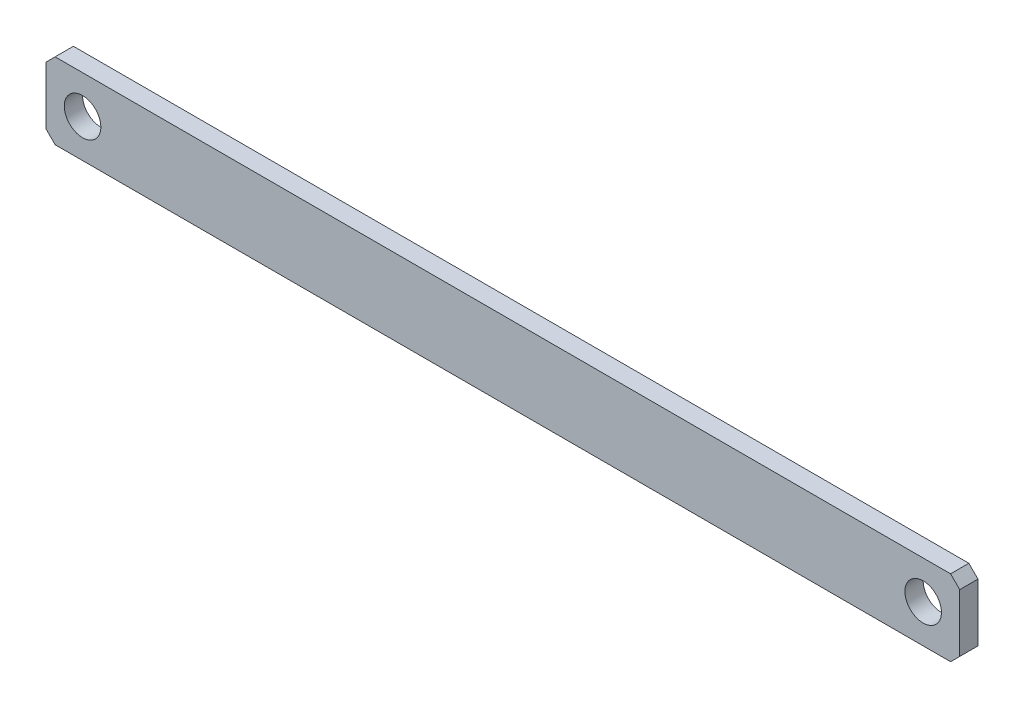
ISO-10303-21;
HEADER;
FILE_DESCRIPTION(('STEP AP214'),'2;1');
FILE_NAME('part.step','',(''),(''),'','','');
FILE_SCHEMA(('AUTOMOTIVE_DESIGN { 1 0 10303 214 1 1 1 1 }'));
ENDSEC;
DATA;
#1=APPLICATION_CONTEXT('core data for automotive mechanical design processes');
#2=APPLICATION_PROTOCOL_DEFINITION('international standard','automotive_design',2000,#1);
#3=PRODUCT_CONTEXT('',#1,'mechanical');
#4=PRODUCT('Part','Part','',(#3));
#5=PRODUCT_RELATED_PRODUCT_CATEGORY('part','',(#4));
#6=PRODUCT_DEFINITION_FORMATION('','',#4);
#7=PRODUCT_DEFINITION_CONTEXT('part definition',#1,'design');
#8=PRODUCT_DEFINITION('design','',#6,#7);
#9=PRODUCT_DEFINITION_SHAPE('','',#8);
#10=(LENGTH_UNIT() NAMED_UNIT(*) SI_UNIT(.MILLI.,.METRE.));
#11=(NAMED_UNIT(*) PLANE_ANGLE_UNIT() SI_UNIT($,.RADIAN.));
#12=(NAMED_UNIT(*) SI_UNIT($,.STERADIAN.) SOLID_ANGLE_UNIT());
#13=UNCERTAINTY_MEASURE_WITH_UNIT(LENGTH_MEASURE(1.E-05),#10,'distance_accuracy_value','');
#14=(GEOMETRIC_REPRESENTATION_CONTEXT(3) GLOBAL_UNCERTAINTY_ASSIGNED_CONTEXT((#13)) GLOBAL_UNIT_ASSIGNED_CONTEXT((#10,
#11,#12)) REPRESENTATION_CONTEXT('',''));
#15=CARTESIAN_POINT('',(0.,0.,0.));
#16=DIRECTION('',(0.,0.,1.));
#17=DIRECTION('',(1.,0.,0.));
#18=AXIS2_PLACEMENT_3D('',#15,#16,#17);
#19=CARTESIAN_POINT('',(0.,7.97330827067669,1.524));
#20=DIRECTION('',(0.,0.,-1.));
#21=DIRECTION('',(-1.,0.,0.));
#22=AXIS2_PLACEMENT_3D('',#19,#20,#21);
#23=PLANE('',#22);
#24=CARTESIAN_POINT('',(3.048,4.79830827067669,1.524));
#25=DIRECTION('',(0.,0.,1.));
#26=DIRECTION('',(1.,0.,0.));
#27=AXIS2_PLACEMENT_3D('',#24,#25,#26);
#28=CIRCLE('',#27,1.524);
#29=CARTESIAN_POINT('',(1.524,4.79830827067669,1.524));
#30=VERTEX_POINT('',#29);
#31=EDGE_CURVE('E167',#30,#30,#28,.T.);
#32=ORIENTED_EDGE('',*,*,#31,.F.);
#33=EDGE_LOOP('',(#32));
#34=FACE_BOUND('',#33,.T.);
#35=DIRECTION('',(1.,0.,0.));
#36=VECTOR('',#35,1.);
#37=CARTESIAN_POINT('',(0.,1.62330827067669,1.524));
#38=LINE('',#37,#36);
#39=CARTESIAN_POINT('',(0.761999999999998,1.62330827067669,1.524));
#40=VERTEX_POINT('',#39);
#41=CARTESIAN_POINT('',(75.438,1.62330827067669,1.524));
#42=VERTEX_POINT('',#41);
#43=EDGE_CURVE('E134',#40,#42,#38,.T.);
#44=ORIENTED_EDGE('',*,*,#43,.T.);
#45=DIRECTION('',(-0.707106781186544,-0.707106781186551,0.));
#46=VECTOR('',#45,1.);
#47=CARTESIAN_POINT('',(76.2,2.3853082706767,1.524));
#48=LINE('',#47,#46);
#49=CARTESIAN_POINT('',(76.2,2.3853082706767,1.524));
#50=VERTEX_POINT('',#49);
#51=EDGE_CURVE('E153',#42,#50,#48,.F.);
#52=ORIENTED_EDGE('',*,*,#51,.T.);
#53=DIRECTION('',(0.,1.,0.));
#54=VECTOR('',#53,1.);
#55=CARTESIAN_POINT('',(76.2,1.6233082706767,1.524));
#56=LINE('',#55,#54);
#57=CARTESIAN_POINT('',(76.2,7.21130827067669,1.524));
#58=VERTEX_POINT('',#57);
#59=EDGE_CURVE('E116',#50,#58,#56,.T.);
#60=ORIENTED_EDGE('',*,*,#59,.T.);
#61=DIRECTION('',(0.707106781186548,-0.707106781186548,0.));
#62=VECTOR('',#61,1.);
#63=CARTESIAN_POINT('',(75.438,7.97330827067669,1.524));
#64=LINE('',#63,#62);
#65=CARTESIAN_POINT('',(75.438,7.9733082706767,1.524));
#66=VERTEX_POINT('',#65);
#67=EDGE_CURVE('E53',#58,#66,#64,.F.);
#68=ORIENTED_EDGE('',*,*,#67,.T.);
#69=DIRECTION('',(-1.,0.,0.));
#70=VECTOR('',#69,1.);
#71=CARTESIAN_POINT('',(0.,7.97330827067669,1.524));
#72=LINE('',#71,#70);
#73=CARTESIAN_POINT('',(0.761999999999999,7.97330827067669,1.524));
#74=VERTEX_POINT('',#73);
#75=EDGE_CURVE('E138',#66,#74,#72,.T.);
#76=ORIENTED_EDGE('',*,*,#75,.T.);
#77=DIRECTION('',(0.707106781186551,0.707106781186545,0.));
#78=VECTOR('',#77,1.);
#79=CARTESIAN_POINT('',(0.,7.2113082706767,1.524));
#80=LINE('',#79,#78);
#81=CARTESIAN_POINT('',(0.,7.2113082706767,1.524));
#82=VERTEX_POINT('',#81);
#83=EDGE_CURVE('E148',#74,#82,#80,.F.);
#84=ORIENTED_EDGE('',*,*,#83,.T.);
#85=DIRECTION('',(0.,-1.,0.));
#86=VECTOR('',#85,1.);
#87=CARTESIAN_POINT('',(0.,1.62330827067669,1.524));
#88=LINE('',#87,#86);
#89=CARTESIAN_POINT('',(0.,2.38530827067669,1.524));
#90=VERTEX_POINT('',#89);
#91=EDGE_CURVE('E126',#82,#90,#88,.T.);
#92=ORIENTED_EDGE('',*,*,#91,.T.);
#93=DIRECTION('',(-0.707106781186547,0.707106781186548,0.));
#94=VECTOR('',#93,1.);
#95=CARTESIAN_POINT('',(0.761999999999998,1.62330827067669,1.524));
#96=LINE('',#95,#94);
#97=EDGE_CURVE('E150',#90,#40,#96,.F.);
#98=ORIENTED_EDGE('',*,*,#97,.T.);
#99=EDGE_LOOP('',(#44,#52,#60,#68,#76,#84,#92,#98));
#100=FACE_BOUND('',#99,.T.);
#101=CARTESIAN_POINT('',(73.152,4.79830827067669,1.524));
#102=DIRECTION('',(0.,0.,1.));
#103=DIRECTION('',(1.,0.,0.));
#104=AXIS2_PLACEMENT_3D('',#101,#102,#103);
#105=CIRCLE('',#104,1.52399999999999);
#106=CARTESIAN_POINT('',(71.628,4.79830827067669,1.524));
#107=VERTEX_POINT('',#106);
#108=EDGE_CURVE('E174',#107,#107,#105,.T.);
#109=ORIENTED_EDGE('',*,*,#108,.F.);
#110=EDGE_LOOP('',(#109));
#111=FACE_BOUND('',#110,.T.);
#112=ADVANCED_FACE('F31',(#34,#100,#111),#23,.F.);
#113=CARTESIAN_POINT('',(0.,7.97330827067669,0.));
#114=DIRECTION('',(0.,0.,-1.));
#115=DIRECTION('',(-1.,0.,0.));
#116=AXIS2_PLACEMENT_3D('',#113,#114,#115);
#117=PLANE('',#116);
#118=CARTESIAN_POINT('',(3.048,4.79830827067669,0.));
#119=DIRECTION('',(0.,0.,1.));
#120=DIRECTION('',(1.,0.,0.));
#121=AXIS2_PLACEMENT_3D('',#118,#119,#120);
#122=CIRCLE('',#121,1.524);
#123=CARTESIAN_POINT('',(1.524,4.79830827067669,0.));
#124=VERTEX_POINT('',#123);
#125=EDGE_CURVE('E169',#124,#124,#122,.T.);
#126=ORIENTED_EDGE('',*,*,#125,.T.);
#127=EDGE_LOOP('',(#126));
#128=FACE_BOUND('',#127,.T.);
#129=DIRECTION('',(0.,1.,0.));
#130=VECTOR('',#129,1.);
#131=CARTESIAN_POINT('',(76.2,1.6233082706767,0.));
#132=LINE('',#131,#130);
#133=CARTESIAN_POINT('',(76.2,2.38530827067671,0.));
#134=VERTEX_POINT('',#133);
#135=CARTESIAN_POINT('',(76.2,7.2113082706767,0.));
#136=VERTEX_POINT('',#135);
#137=EDGE_CURVE('E114',#134,#136,#132,.T.);
#138=ORIENTED_EDGE('',*,*,#137,.F.);
#139=DIRECTION('',(0.707106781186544,0.707106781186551,0.));
#140=VECTOR('',#139,1.);
#141=CARTESIAN_POINT('',(40.8940000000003,-32.9206917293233,0.));
#142=LINE('',#141,#140);
#143=CARTESIAN_POINT('',(75.438,1.6233082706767,0.));
#144=VERTEX_POINT('',#143);
#145=EDGE_CURVE('E97',#134,#144,#142,.F.);
#146=ORIENTED_EDGE('',*,*,#145,.T.);
#147=DIRECTION('',(1.,0.,0.));
#148=VECTOR('',#147,1.);
#149=CARTESIAN_POINT('',(0.,1.62330827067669,0.));
#150=LINE('',#149,#148);
#151=CARTESIAN_POINT('',(0.761999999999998,1.62330827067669,0.));
#152=VERTEX_POINT('',#151);
#153=EDGE_CURVE('E124',#152,#144,#150,.T.);
#154=ORIENTED_EDGE('',*,*,#153,.F.);
#155=DIRECTION('',(0.707106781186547,-0.707106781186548,0.));
#156=VECTOR('',#155,1.);
#157=CARTESIAN_POINT('',(-2.794,5.1793082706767,0.));
#158=LINE('',#157,#156);
#159=CARTESIAN_POINT('',(0.,2.38530827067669,0.));
#160=VERTEX_POINT('',#159);
#161=EDGE_CURVE('E142',#152,#160,#158,.F.);
#162=ORIENTED_EDGE('',*,*,#161,.T.);
#163=DIRECTION('',(0.,-1.,0.));
#164=VECTOR('',#163,1.);
#165=CARTESIAN_POINT('',(0.,1.62330827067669,0.));
#166=LINE('',#165,#164);
#167=CARTESIAN_POINT('',(0.,7.2113082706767,0.));
#168=VERTEX_POINT('',#167);
#169=EDGE_CURVE('E128',#168,#160,#166,.T.);
#170=ORIENTED_EDGE('',*,*,#169,.F.);
#171=DIRECTION('',(-0.707106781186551,-0.707106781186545,0.));
#172=VECTOR('',#171,1.);
#173=CARTESIAN_POINT('',(0.380999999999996,7.5923082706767,0.));
#174=LINE('',#173,#172);
#175=CARTESIAN_POINT('',(0.761999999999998,7.97330827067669,0.));
#176=VERTEX_POINT('',#175);
#177=EDGE_CURVE('E117',#168,#176,#174,.F.);
#178=ORIENTED_EDGE('',*,*,#177,.T.);
#179=DIRECTION('',(-1.,0.,0.));
#180=VECTOR('',#179,1.);
#181=CARTESIAN_POINT('',(0.,7.97330827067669,0.));
#182=LINE('',#181,#180);
#183=CARTESIAN_POINT('',(75.438,7.97330827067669,0.));
#184=VERTEX_POINT('',#183);
#185=EDGE_CURVE('E123',#184,#176,#182,.T.);
#186=ORIENTED_EDGE('',*,*,#185,.F.);
#187=DIRECTION('',(-0.707106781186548,0.707106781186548,0.));
#188=VECTOR('',#187,1.);
#189=CARTESIAN_POINT('',(37.719,45.6923082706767,0.));
#190=LINE('',#189,#188);
#191=EDGE_CURVE('E108',#184,#136,#190,.F.);
#192=ORIENTED_EDGE('',*,*,#191,.T.);
#193=EDGE_LOOP('',(#138,#146,#154,#162,#170,#178,#186,#192));
#194=FACE_BOUND('',#193,.T.);
#195=CARTESIAN_POINT('',(73.152,4.79830827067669,0.));
#196=DIRECTION('',(0.,0.,1.));
#197=DIRECTION('',(1.,0.,0.));
#198=AXIS2_PLACEMENT_3D('',#195,#196,#197);
#199=CIRCLE('',#198,1.52399999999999);
#200=CARTESIAN_POINT('',(71.628,4.79830827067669,0.));
#201=VERTEX_POINT('',#200);
#202=EDGE_CURVE('E177',#201,#201,#199,.T.);
#203=ORIENTED_EDGE('',*,*,#202,.T.);
#204=EDGE_LOOP('',(#203));
#205=FACE_BOUND('',#204,.T.);
#206=ADVANCED_FACE('F120',(#128,#194,#205),#117,.T.);
#207=CARTESIAN_POINT('',(0.,1.62330827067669,1.524));
#208=DIRECTION('',(1.,0.,0.));
#209=DIRECTION('',(0.,0.,-1.));
#210=AXIS2_PLACEMENT_3D('',#207,#208,#209);
#211=PLANE('',#210);
#212=ORIENTED_EDGE('',*,*,#169,.T.);
#213=DIRECTION('',(0.,0.,1.));
#214=VECTOR('',#213,1.);
#215=CARTESIAN_POINT('',(0.,2.38530827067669,1.524));
#216=LINE('',#215,#214);
#217=EDGE_CURVE('E11',#160,#90,#216,.T.);
#218=ORIENTED_EDGE('',*,*,#217,.T.);
#219=ORIENTED_EDGE('',*,*,#91,.F.);
#220=DIRECTION('',(0.,0.,-1.));
#221=VECTOR('',#220,1.);
#222=CARTESIAN_POINT('',(0.,7.2113082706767,1.524));
#223=LINE('',#222,#221);
#224=EDGE_CURVE('E39',#82,#168,#223,.T.);
#225=ORIENTED_EDGE('',*,*,#224,.T.);
#226=EDGE_LOOP('',(#212,#218,#219,#225));
#227=FACE_BOUND('',#226,.T.);
#228=ADVANCED_FACE('F33',(#227),#211,.F.);
#229=CARTESIAN_POINT('',(0.,1.62330827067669,1.524));
#230=DIRECTION('',(0.,1.,0.));
#231=DIRECTION('',(-1.,0.,0.));
#232=AXIS2_PLACEMENT_3D('',#229,#230,#231);
#233=PLANE('',#232);
#234=ORIENTED_EDGE('',*,*,#153,.T.);
#235=DIRECTION('',(0.,0.,1.));
#236=VECTOR('',#235,1.);
#237=CARTESIAN_POINT('',(75.438,1.6233082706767,1.524));
#238=LINE('',#237,#236);
#239=EDGE_CURVE('E102',#144,#42,#238,.T.);
#240=ORIENTED_EDGE('',*,*,#239,.T.);
#241=ORIENTED_EDGE('',*,*,#43,.F.);
#242=DIRECTION('',(0.,0.,-1.));
#243=VECTOR('',#242,1.);
#244=CARTESIAN_POINT('',(0.761999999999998,1.62330827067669,1.524));
#245=LINE('',#244,#243);
#246=EDGE_CURVE('E107',#40,#152,#245,.T.);
#247=ORIENTED_EDGE('',*,*,#246,.T.);
#248=EDGE_LOOP('',(#234,#240,#241,#247));
#249=FACE_BOUND('',#248,.T.);
#250=ADVANCED_FACE('F208',(#249),#233,.F.);
#251=CARTESIAN_POINT('',(76.2,1.6233082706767,1.524));
#252=DIRECTION('',(-1.,0.,0.));
#253=DIRECTION('',(0.,0.,1.));
#254=AXIS2_PLACEMENT_3D('',#251,#252,#253);
#255=PLANE('',#254);
#256=ORIENTED_EDGE('',*,*,#59,.F.);
#257=DIRECTION('',(0.,0.,-1.));
#258=VECTOR('',#257,1.);
#259=CARTESIAN_POINT('',(76.2,2.3853082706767,1.524));
#260=LINE('',#259,#258);
#261=EDGE_CURVE('E101',#50,#134,#260,.T.);
#262=ORIENTED_EDGE('',*,*,#261,.T.);
#263=ORIENTED_EDGE('',*,*,#137,.T.);
#264=DIRECTION('',(0.,0.,1.));
#265=VECTOR('',#264,1.);
#266=CARTESIAN_POINT('',(76.2,7.2113082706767,1.524));
#267=LINE('',#266,#265);
#268=EDGE_CURVE('E118',#136,#58,#267,.T.);
#269=ORIENTED_EDGE('',*,*,#268,.T.);
#270=EDGE_LOOP('',(#256,#262,#263,#269));
#271=FACE_BOUND('',#270,.T.);
#272=ADVANCED_FACE('F113',(#271),#255,.F.);
#273=CARTESIAN_POINT('',(0.,7.97330827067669,1.524));
#274=DIRECTION('',(0.,-1.,0.));
#275=DIRECTION('',(0.,0.,-1.));
#276=AXIS2_PLACEMENT_3D('',#273,#274,#275);
#277=PLANE('',#276);
#278=ORIENTED_EDGE('',*,*,#75,.F.);
#279=DIRECTION('',(0.,0.,-1.));
#280=VECTOR('',#279,1.);
#281=CARTESIAN_POINT('',(75.438,7.97330827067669,1.524));
#282=LINE('',#281,#280);
#283=EDGE_CURVE('E156',#66,#184,#282,.T.);
#284=ORIENTED_EDGE('',*,*,#283,.T.);
#285=ORIENTED_EDGE('',*,*,#185,.T.);
#286=DIRECTION('',(0.,0.,1.));
#287=VECTOR('',#286,1.);
#288=CARTESIAN_POINT('',(0.761999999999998,7.97330827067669,1.524));
#289=LINE('',#288,#287);
#290=EDGE_CURVE('E46',#176,#74,#289,.T.);
#291=ORIENTED_EDGE('',*,*,#290,.T.);
#292=EDGE_LOOP('',(#278,#284,#285,#291));
#293=FACE_BOUND('',#292,.T.);
#294=ADVANCED_FACE('F192',(#293),#277,.F.);
#295=CARTESIAN_POINT('',(3.048,4.79830827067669,1.524));
#296=DIRECTION('',(0.,0.,-1.));
#297=DIRECTION('',(-1.,0.,0.));
#298=AXIS2_PLACEMENT_3D('',#295,#296,#297);
#299=CYLINDRICAL_SURFACE('',#298,1.524);
#300=CARTESIAN_POINT('',(1.524,4.79830827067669,1.524));
#301=CARTESIAN_POINT('',(1.524,4.79830827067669,1.508125));
#302=CARTESIAN_POINT('',(1.524,4.79830827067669,1.49225));
#303=CARTESIAN_POINT('',(1.524,4.79830827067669,1.4605));
#304=CARTESIAN_POINT('',(1.524,4.79830827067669,1.444625));
#305=CARTESIAN_POINT('',(1.524,4.79830827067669,1.412875));
#306=CARTESIAN_POINT('',(1.524,4.79830827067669,1.397));
#307=CARTESIAN_POINT('',(1.524,4.79830827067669,1.36525));
#308=CARTESIAN_POINT('',(1.524,4.79830827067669,1.349375));
#309=CARTESIAN_POINT('',(1.524,4.79830827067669,1.317625));
#310=CARTESIAN_POINT('',(1.524,4.79830827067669,1.30175));
#311=CARTESIAN_POINT('',(1.524,4.79830827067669,1.27));
#312=CARTESIAN_POINT('',(1.524,4.79830827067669,1.254125));
#313=CARTESIAN_POINT('',(1.524,4.79830827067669,1.222375));
#314=CARTESIAN_POINT('',(1.524,4.79830827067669,1.2065));
#315=CARTESIAN_POINT('',(1.524,4.79830827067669,1.17475));
#316=CARTESIAN_POINT('',(1.524,4.79830827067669,1.158875));
#317=CARTESIAN_POINT('',(1.524,4.79830827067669,1.127125));
#318=CARTESIAN_POINT('',(1.524,4.79830827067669,1.11125));
#319=CARTESIAN_POINT('',(1.524,4.79830827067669,1.0795));
#320=CARTESIAN_POINT('',(1.524,4.79830827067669,1.063625));
#321=CARTESIAN_POINT('',(1.524,4.79830827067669,1.031875));
#322=CARTESIAN_POINT('',(1.524,4.79830827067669,1.016));
#323=CARTESIAN_POINT('',(1.524,4.79830827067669,0.98425));
#324=CARTESIAN_POINT('',(1.524,4.79830827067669,0.968375));
#325=CARTESIAN_POINT('',(1.524,4.79830827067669,0.936625));
#326=CARTESIAN_POINT('',(1.524,4.79830827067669,0.92075));
#327=CARTESIAN_POINT('',(1.524,4.79830827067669,0.889));
#328=CARTESIAN_POINT('',(1.524,4.79830827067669,0.873125));
#329=CARTESIAN_POINT('',(1.524,4.79830827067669,0.841375));
#330=CARTESIAN_POINT('',(1.524,4.79830827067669,0.8255));
#331=CARTESIAN_POINT('',(1.524,4.79830827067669,0.79375));
#332=CARTESIAN_POINT('',(1.524,4.79830827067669,0.777875));
#333=CARTESIAN_POINT('',(1.524,4.79830827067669,0.746125));
#334=CARTESIAN_POINT('',(1.524,4.79830827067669,0.73025));
#335=CARTESIAN_POINT('',(1.524,4.79830827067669,0.6985));
#336=CARTESIAN_POINT('',(1.524,4.79830827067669,0.682625));
#337=CARTESIAN_POINT('',(1.524,4.79830827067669,0.650875));
#338=CARTESIAN_POINT('',(1.524,4.79830827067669,0.635));
#339=CARTESIAN_POINT('',(1.524,4.79830827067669,0.60325));
#340=CARTESIAN_POINT('',(1.524,4.79830827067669,0.587375));
#341=CARTESIAN_POINT('',(1.524,4.79830827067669,0.555625));
#342=CARTESIAN_POINT('',(1.524,4.79830827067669,0.53975));
#343=CARTESIAN_POINT('',(1.524,4.79830827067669,0.508));
#344=CARTESIAN_POINT('',(1.524,4.79830827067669,0.492125));
#345=CARTESIAN_POINT('',(1.524,4.79830827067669,0.460375));
#346=CARTESIAN_POINT('',(1.524,4.79830827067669,0.4445));
#347=CARTESIAN_POINT('',(1.524,4.79830827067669,0.41275));
#348=CARTESIAN_POINT('',(1.524,4.79830827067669,0.396875));
#349=CARTESIAN_POINT('',(1.524,4.79830827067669,0.365125));
#350=CARTESIAN_POINT('',(1.524,4.79830827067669,0.34925));
#351=CARTESIAN_POINT('',(1.524,4.79830827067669,0.3175));
#352=CARTESIAN_POINT('',(1.524,4.79830827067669,0.301625));
#353=CARTESIAN_POINT('',(1.524,4.79830827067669,0.269875));
#354=CARTESIAN_POINT('',(1.524,4.79830827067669,0.254));
#355=CARTESIAN_POINT('',(1.524,4.79830827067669,0.22225));
#356=CARTESIAN_POINT('',(1.524,4.79830827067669,0.206375));
#357=CARTESIAN_POINT('',(1.524,4.79830827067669,0.174625));
#358=CARTESIAN_POINT('',(1.524,4.79830827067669,0.15875));
#359=CARTESIAN_POINT('',(1.524,4.79830827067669,0.127));
#360=CARTESIAN_POINT('',(1.524,4.79830827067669,0.111125));
#361=CARTESIAN_POINT('',(1.524,4.79830827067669,0.079375));
#362=CARTESIAN_POINT('',(1.524,4.79830827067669,0.0635));
#363=CARTESIAN_POINT('',(1.524,4.79830827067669,0.0317499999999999));
#364=CARTESIAN_POINT('',(1.524,4.79830827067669,0.015875));
#365=CARTESIAN_POINT('',(1.524,4.79830827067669,0.));
#366=B_SPLINE_CURVE_WITH_KNOTS('',3,(#300,#301,#302,#303,#304,#305,#306,#307,#308,#309,#310,
#311,#312,#313,#314,#315,#316,#317,#318,#319,#320,#321,#322,#323,#324,#325,#326,#327,#328,#329,
#330,#331,#332,#333,#334,#335,#336,#337,#338,#339,#340,#341,#342,#343,#344,#345,#346,#347,#348,
#349,#350,#351,#352,#353,#354,#355,#356,#357,#358,#359,#360,#361,#362,#363,#364,#365),
.UNSPECIFIED.,.F.,.F.,(4,2,2,2,2,2,2,2,2,2,2,2,2,2,2,2,2,2,2,2,2,2,2,2,2,2,2,2,2,2,2,2,4),(0.,
0.0476249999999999,0.0952499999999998,0.142875,0.1905,0.238125,0.28575,0.333375,0.381,0.428625,
0.47625,0.523875,0.5715,0.619125,0.66675,0.714375,0.762,0.809625,0.85725,0.904875,0.9525,
1.000125,1.04775,1.095375,1.143,1.190625,1.23825,1.285875,1.3335,1.381125,1.42875,1.476375,
1.524),.UNSPECIFIED.);
#367=EDGE_CURVE('BSEAM183',#30,#124,#366,.T.);
#368=ORIENTED_EDGE('',*,*,#31,.T.);
#369=ORIENTED_EDGE('',*,*,#125,.F.);
#370=ORIENTED_EDGE('',*,*,#367,.T.);
#371=ORIENTED_EDGE('',*,*,#367,.F.);
#372=EDGE_LOOP('',(#368,#370,#369,#371));
#373=FACE_BOUND('',#372,.T.);
#374=ADVANCED_FACE('F183',(#373),#299,.F.);
#375=CARTESIAN_POINT('',(73.152,4.79830827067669,1.524));
#376=DIRECTION('',(0.,0.,-1.));
#377=DIRECTION('',(-1.,0.,0.));
#378=AXIS2_PLACEMENT_3D('',#375,#376,#377);
#379=CYLINDRICAL_SURFACE('',#378,1.52399999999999);
#380=CARTESIAN_POINT('',(71.628,4.79830827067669,1.524));
#381=CARTESIAN_POINT('',(71.628,4.79830827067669,1.508125));
#382=CARTESIAN_POINT('',(71.628,4.79830827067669,1.49225));
#383=CARTESIAN_POINT('',(71.628,4.79830827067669,1.4605));
#384=CARTESIAN_POINT('',(71.628,4.79830827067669,1.444625));
#385=CARTESIAN_POINT('',(71.628,4.79830827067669,1.412875));
#386=CARTESIAN_POINT('',(71.628,4.79830827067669,1.397));
#387=CARTESIAN_POINT('',(71.628,4.79830827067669,1.36525));
#388=CARTESIAN_POINT('',(71.628,4.79830827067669,1.349375));
#389=CARTESIAN_POINT('',(71.628,4.79830827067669,1.317625));
#390=CARTESIAN_POINT('',(71.628,4.79830827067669,1.30175));
#391=CARTESIAN_POINT('',(71.628,4.79830827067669,1.27));
#392=CARTESIAN_POINT('',(71.628,4.79830827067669,1.254125));
#393=CARTESIAN_POINT('',(71.628,4.79830827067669,1.222375));
#394=CARTESIAN_POINT('',(71.628,4.79830827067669,1.2065));
#395=CARTESIAN_POINT('',(71.628,4.79830827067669,1.17475));
#396=CARTESIAN_POINT('',(71.628,4.79830827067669,1.158875));
#397=CARTESIAN_POINT('',(71.628,4.79830827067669,1.127125));
#398=CARTESIAN_POINT('',(71.628,4.79830827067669,1.11125));
#399=CARTESIAN_POINT('',(71.628,4.79830827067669,1.0795));
#400=CARTESIAN_POINT('',(71.628,4.79830827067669,1.063625));
#401=CARTESIAN_POINT('',(71.628,4.79830827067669,1.031875));
#402=CARTESIAN_POINT('',(71.628,4.79830827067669,1.016));
#403=CARTESIAN_POINT('',(71.628,4.79830827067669,0.98425));
#404=CARTESIAN_POINT('',(71.628,4.79830827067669,0.968375));
#405=CARTESIAN_POINT('',(71.628,4.79830827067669,0.936625));
#406=CARTESIAN_POINT('',(71.628,4.79830827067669,0.92075));
#407=CARTESIAN_POINT('',(71.628,4.79830827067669,0.889));
#408=CARTESIAN_POINT('',(71.628,4.79830827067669,0.873125));
#409=CARTESIAN_POINT('',(71.628,4.79830827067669,0.841375));
#410=CARTESIAN_POINT('',(71.628,4.79830827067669,0.8255));
#411=CARTESIAN_POINT('',(71.628,4.79830827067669,0.79375));
#412=CARTESIAN_POINT('',(71.628,4.79830827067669,0.777875));
#413=CARTESIAN_POINT('',(71.628,4.79830827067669,0.746125));
#414=CARTESIAN_POINT('',(71.628,4.79830827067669,0.73025));
#415=CARTESIAN_POINT('',(71.628,4.79830827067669,0.6985));
#416=CARTESIAN_POINT('',(71.628,4.79830827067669,0.682625));
#417=CARTESIAN_POINT('',(71.628,4.79830827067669,0.650875));
#418=CARTESIAN_POINT('',(71.628,4.79830827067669,0.635));
#419=CARTESIAN_POINT('',(71.628,4.79830827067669,0.60325));
#420=CARTESIAN_POINT('',(71.628,4.79830827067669,0.587375));
#421=CARTESIAN_POINT('',(71.628,4.79830827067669,0.555625));
#422=CARTESIAN_POINT('',(71.628,4.79830827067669,0.53975));
#423=CARTESIAN_POINT('',(71.628,4.79830827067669,0.508));
#424=CARTESIAN_POINT('',(71.628,4.79830827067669,0.492125));
#425=CARTESIAN_POINT('',(71.628,4.79830827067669,0.460375));
#426=CARTESIAN_POINT('',(71.628,4.79830827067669,0.4445));
#427=CARTESIAN_POINT('',(71.628,4.79830827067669,0.41275));
#428=CARTESIAN_POINT('',(71.628,4.79830827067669,0.396875));
#429=CARTESIAN_POINT('',(71.628,4.79830827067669,0.365125));
#430=CARTESIAN_POINT('',(71.628,4.79830827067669,0.34925));
#431=CARTESIAN_POINT('',(71.628,4.79830827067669,0.3175));
#432=CARTESIAN_POINT('',(71.628,4.79830827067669,0.301625));
#433=CARTESIAN_POINT('',(71.628,4.79830827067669,0.269875));
#434=CARTESIAN_POINT('',(71.628,4.79830827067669,0.254));
#435=CARTESIAN_POINT('',(71.628,4.79830827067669,0.22225));
#436=CARTESIAN_POINT('',(71.628,4.79830827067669,0.206375));
#437=CARTESIAN_POINT('',(71.628,4.79830827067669,0.174625));
#438=CARTESIAN_POINT('',(71.628,4.79830827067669,0.15875));
#439=CARTESIAN_POINT('',(71.628,4.79830827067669,0.127));
#440=CARTESIAN_POINT('',(71.628,4.79830827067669,0.111125));
#441=CARTESIAN_POINT('',(71.628,4.79830827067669,0.079375));
#442=CARTESIAN_POINT('',(71.628,4.79830827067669,0.0635));
#443=CARTESIAN_POINT('',(71.628,4.79830827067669,0.0317499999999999));
#444=CARTESIAN_POINT('',(71.628,4.79830827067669,0.015875));
#445=CARTESIAN_POINT('',(71.628,4.79830827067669,0.));
#446=B_SPLINE_CURVE_WITH_KNOTS('',3,(#380,#381,#382,#383,#384,#385,#386,#387,#388,#389,#390,
#391,#392,#393,#394,#395,#396,#397,#398,#399,#400,#401,#402,#403,#404,#405,#406,#407,#408,#409,
#410,#411,#412,#413,#414,#415,#416,#417,#418,#419,#420,#421,#422,#423,#424,#425,#426,#427,#428,
#429,#430,#431,#432,#433,#434,#435,#436,#437,#438,#439,#440,#441,#442,#443,#444,#445),
.UNSPECIFIED.,.F.,.F.,(4,2,2,2,2,2,2,2,2,2,2,2,2,2,2,2,2,2,2,2,2,2,2,2,2,2,2,2,2,2,2,2,4),(0.,
0.0476249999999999,0.0952499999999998,0.142875,0.1905,0.238125,0.28575,0.333375,0.381,0.428625,
0.47625,0.523875,0.5715,0.619125,0.66675,0.714375,0.762,0.809625,0.85725,0.904875,0.9525,
1.000125,1.04775,1.095375,1.143,1.190625,1.23825,1.285875,1.3335,1.381125,1.42875,1.476375,
1.524),.UNSPECIFIED.);
#447=EDGE_CURVE('BSEAM181',#107,#201,#446,.T.);
#448=ORIENTED_EDGE('',*,*,#108,.T.);
#449=ORIENTED_EDGE('',*,*,#202,.F.);
#450=ORIENTED_EDGE('',*,*,#447,.T.);
#451=ORIENTED_EDGE('',*,*,#447,.F.);
#452=EDGE_LOOP('',(#448,#450,#449,#451));
#453=FACE_BOUND('',#452,.T.);
#454=ADVANCED_FACE('F181',(#453),#379,.F.);
#455=CARTESIAN_POINT('',(76.2,2.3853082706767,1.524));
#456=DIRECTION('',(-0.707106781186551,0.707106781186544,0.));
#457=DIRECTION('',(-0.707106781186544,-0.707106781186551,0.));
#458=AXIS2_PLACEMENT_3D('',#455,#456,#457);
#459=PLANE('',#458);
#460=ORIENTED_EDGE('',*,*,#51,.F.);
#461=ORIENTED_EDGE('',*,*,#239,.F.);
#462=ORIENTED_EDGE('',*,*,#145,.F.);
#463=ORIENTED_EDGE('',*,*,#261,.F.);
#464=EDGE_LOOP('',(#460,#461,#462,#463));
#465=FACE_BOUND('',#464,.T.);
#466=ADVANCED_FACE('F100',(#465),#459,.F.);
#467=CARTESIAN_POINT('',(75.438,7.97330827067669,1.524));
#468=DIRECTION('',(-0.707106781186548,-0.707106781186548,0.));
#469=DIRECTION('',(0.707106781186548,-0.707106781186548,0.));
#470=AXIS2_PLACEMENT_3D('',#467,#468,#469);
#471=PLANE('',#470);
#472=ORIENTED_EDGE('',*,*,#67,.F.);
#473=ORIENTED_EDGE('',*,*,#268,.F.);
#474=ORIENTED_EDGE('',*,*,#191,.F.);
#475=ORIENTED_EDGE('',*,*,#283,.F.);
#476=EDGE_LOOP('',(#472,#473,#474,#475));
#477=FACE_BOUND('',#476,.T.);
#478=ADVANCED_FACE('F190',(#477),#471,.F.);
#479=CARTESIAN_POINT('',(0.761999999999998,1.62330827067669,1.524));
#480=DIRECTION('',(0.707106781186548,0.707106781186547,0.));
#481=DIRECTION('',(-0.707106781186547,0.707106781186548,0.));
#482=AXIS2_PLACEMENT_3D('',#479,#480,#481);
#483=PLANE('',#482);
#484=ORIENTED_EDGE('',*,*,#97,.F.);
#485=ORIENTED_EDGE('',*,*,#217,.F.);
#486=ORIENTED_EDGE('',*,*,#161,.F.);
#487=ORIENTED_EDGE('',*,*,#246,.F.);
#488=EDGE_LOOP('',(#484,#485,#486,#487));
#489=FACE_BOUND('',#488,.T.);
#490=ADVANCED_FACE('F218',(#489),#483,.F.);
#491=CARTESIAN_POINT('',(0.,7.2113082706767,1.524));
#492=DIRECTION('',(0.707106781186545,-0.707106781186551,0.));
#493=DIRECTION('',(0.707106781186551,0.707106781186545,0.));
#494=AXIS2_PLACEMENT_3D('',#491,#492,#493);
#495=PLANE('',#494);
#496=ORIENTED_EDGE('',*,*,#83,.F.);
#497=ORIENTED_EDGE('',*,*,#290,.F.);
#498=ORIENTED_EDGE('',*,*,#177,.F.);
#499=ORIENTED_EDGE('',*,*,#224,.F.);
#500=EDGE_LOOP('',(#496,#497,#498,#499));
#501=FACE_BOUND('',#500,.T.);
#502=ADVANCED_FACE('F220',(#501),#495,.F.);
#503=CLOSED_SHELL('',(#112,#206,#228,#250,#272,#294,#374,#454,#466,#478,#490,#502));
#504=MANIFOLD_SOLID_BREP('B2',#503);
#505=ADVANCED_BREP_SHAPE_REPRESENTATION('',(#18,#504),#14);
#506=SHAPE_DEFINITION_REPRESENTATION(#9,#505);
ENDSEC;
END-ISO-10303-21;
